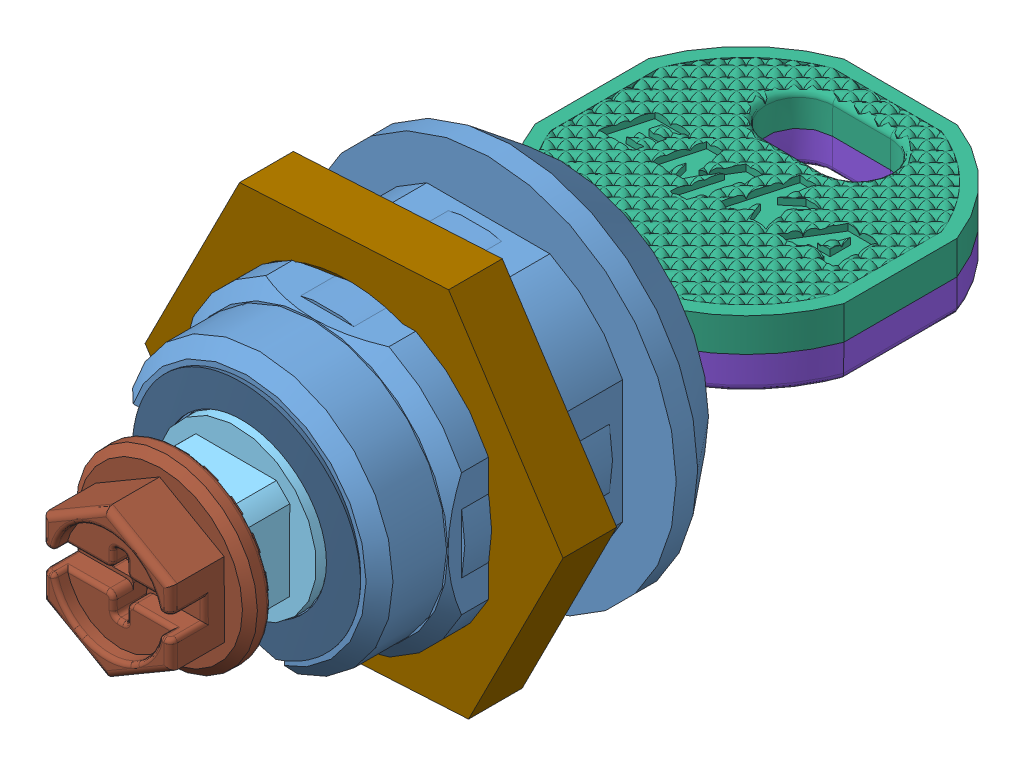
SolidWorks assembly 21.1752 CYLINDER LOCK.SLDASM, configuration Default (file format 3800). Lengths in mm.
Overall size (32.62 28.67 59.84).
17 component instances, 11 part files, 8 mates.
Components (placement in the parent):
- 1048-02A_PRT-1: 1048-02A_PRT.SLDPRT [Default] at origin size (28 28 23.4)
- 1108-U01_ASM-1: 1108-U01_ASM.sldasm [Default] at (0 0 -0.65) x (0.003539 0.999994 0) z (0 0 -1) size (16.7 23.04 53.87)
  - 1108-29-1: 1108-29.sldprt [Default] at (0 1.15 -16.525) size (6.5 11.7 0.8)
  - 1108-29-2: 1108-29.sldprt [Default] at (0 1.15 -14.225) size (6.5 11.7 0.8)
  - 1108-29-3: 1108-29.sldprt [Default] at (0 1.15 -11.925) size (6.5 11.7 0.8)
  - 1108-29-4: 1108-29.sldprt [Default] at (0 1.15 -9.625) size (6.5 11.7 0.8)
  - 1108-29-5: 1108-29.sldprt [Default] at (0 1.15 -7.375) size (6.5 11.7 0.8)
  - 1108-26-1: 1108-26.sldprt [Default] at (0 0 0.3) x (-1 0 0) z (0 0 1) size (16.7 16.7 2.18)
  - 1108-28-1: 1108-28.sldprt [Default] at (-0.2847 -1.35 -0.75) size (3.5 13 1.2)
  - 1108-07-01_AF0_PRT-1: 1108-07-01_AF0_PRT.sldprt [Default] x (0 -1 0) z (0 0 1) size (16.15 15.38 29.69)
  - 1108-U35_ASM1-1: 1108-U35_ASM1.sldasm [Default] at (-1.25 -0.65 -1.2) x (0 1 0) z (0 0 -1) size (23.04 5.13 48.02)
    - 1108-15_PRT1-1: 1108-15_PRT1.sldprt [Default] at (0 0.9 -15) x (-1 0 0) z (0 0 -1) size (23 4.17 23)
    - 1108-14-333_PRT1-1: 1108-14-333_PRT1.sldprt [Default] at origin size (9.62 1.8 38)
    - 1108-15-01_PRT1-1: 1108-15-01_PRT1.sldprt [Default] at (0 0.9 -15) x (-1 0 0) z (0 0 1) size (23.04 4.17 23.04)
- 1000-02-1: 1000-02.sldprt [Default] at (0 0 11.4) x (0.998485 0.055032 0) z (0.055032 -0.998485 0) size (31.18 4.57 27)
- 1048-01__PRT-1: 1048-01__PRT.SLDPRT [Default] at (0 0 23.1) x (0.95563 -0.294568 0) z (-0.294568 -0.95563 0) size (17 1.08 16.08)
- 1000-277-02_PRT-1: 1000-277-02_PRT.SLDPRT [Default] at (0 0 28.35) x (0 0 1) z (-0.999984 -0.005591 0) size (11.52 13.5 13.5)
Mates (geometry in assembly coordinates):
- Coincident1: coincident aligned: axis of 1108-U01_ASM-1/1108-07-01_AF0_PRT-1; axis of 1048-02A_PRT-1
- Distance1: distance = 0.95 mm aligned: plane of 1048-02A_PRT-1 through (0 0 0) normal (0 0 -1); plane of 1108-U01_ASM-1/1108-26-1 through (0 0 -0.95) normal (0 0 -1)
- Coincident3: coincident anti-aligned: axis of 1048-02A_PRT-1; axis of 1048-01__PRT-1
- Tangent1: tangent aligned: plane of 1048-02A_PRT-1 through (0 0 23.4) normal (0 0 1); cylinder of 1048-01__PRT-1
- Coincident4: coincident anti-aligned: axis of 1048-02A_PRT-1; axis of 1000-02-1
- Distance2: distance = 6 mm anti-aligned: plane of 1000-02-1 through (0 0 11.4) normal (0 0 -1); plane of 1048-02A_PRT-1 through (0 0 5.4) normal (0 0 1)
- Coincident6: coincident aligned: axis of 1000-277-02_PRT-1; axis of 1048-02A_PRT-1
- Distance3: distance = 0.3 mm anti-aligned: plane of 1108-U01_ASM-1/1108-07-01_AF0_PRT-1 through (0 0 27.9) normal (0 0 1); plane of 1000-277-02_PRT-1 through (0 0 28.2) normal (0 0 -1)
